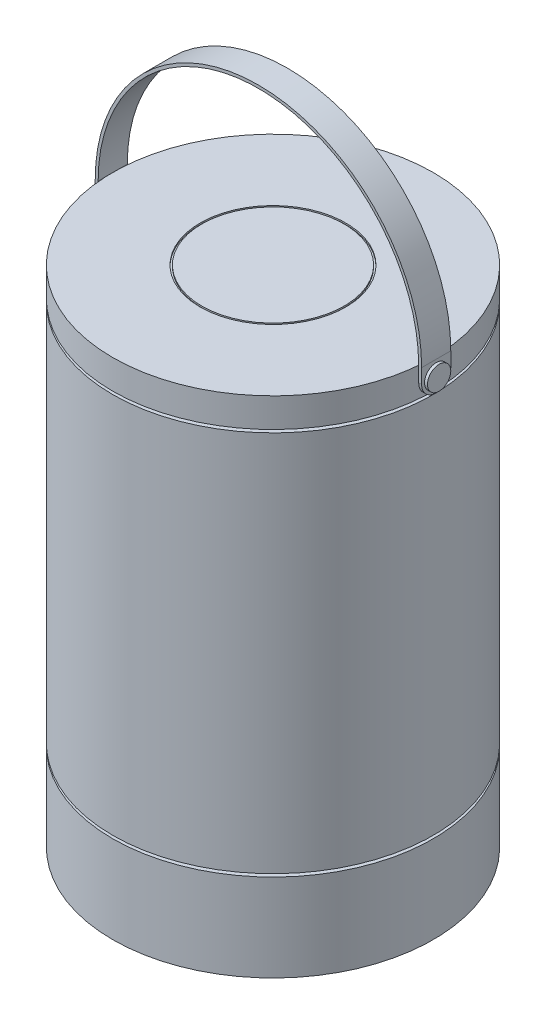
from build123d import *

# Parameters (mm, degrees)
CROQUIS1_R                   = 55
SALIENTE_EXTRUIR1_DEPTH      = 173
CROQUIS2_R                   = 55
CROQUIS2_R_2                 = 40
CORTAR_EXTRUIR1_DEPTH        = 1
CORTAR_EXTRUIR2_START        = -1
CROQUIS4_R                   = 55
CROQUIS4_R_2                 = 40
CORTAR_EXTRUIR2_DEPTH        = 1
SALIENTE_EXTRUIR2_DEPTH      = 5
SALIENTE_EXTRUIR2_DEPTH_BACK = 5
REDONDEO1_RADIUS             = 5
REDONDEO1_LENGTH             = 1
REDONDEO2_RADIUS             = 5
REDONDEO2_LENGTH             = 1
CROQUIS7_R                   = 4
SALIENTE_EXTRUIR3_DEPTH      = 1
CROQUIS8_R                   = 25
CROQUIS8_R_2                 = 24.42
CORTAR_EXTRUIR3_DEPTH        = 0.5


with BuildPart() as part:
    # Croquis1 → Saliente-Extruir1 (new body)
    with BuildSketch(Plane(origin=(0, 0, 0), x_dir=(1, 0, 0), z_dir=(0, 1, 0))):
        with Locations(Location((0, 0, 0), (0, 0, 270))):
            Circle(CROQUIS1_R)
    extrude(amount=SALIENTE_EXTRUIR1_DEPTH)

    # Croquis2 → Cortar-Extruir1 (cut)
    with BuildSketch(Plane(origin=(0, 30, 0), x_dir=(-1, 0, 0), z_dir=(0, -1, 0))):
        with Locations(Location((0, 0, 0), (0, 0, 90))):
            Circle(CROQUIS2_R)
        with Locations(Location((0, 0, 0), (0, 0, 90))):
            Circle(CROQUIS2_R_2, mode=Mode.SUBTRACT)
    extrude(amount=-CORTAR_EXTRUIR1_DEPTH, mode=Mode.SUBTRACT)

    # Croquis4 → Cortar-Extruir2 (cut)
    with BuildSketch(Plane(origin=(0, 163, 0), x_dir=(1, 0, 0), z_dir=(0, 1, 0)).offset(CORTAR_EXTRUIR2_START)):
        with Locations(Location((0, 0, 0), (0, 0, 90))):
            Circle(CROQUIS4_R)
        with Locations(Location((0, 0, 0), (0, 0, 90))):
            Circle(CROQUIS4_R_2, mode=Mode.SUBTRACT)
    extrude(amount=CORTAR_EXTRUIR2_DEPTH, mode=Mode.SUBTRACT)

    # Croquis8 → Cortar-Extruir3 (cut)
    with BuildSketch(Plane(origin=(0, 173, 0), x_dir=(1, 0, 0), z_dir=(0, 1, 0))):
        with Locations(Location((0, 0, 0), (0, 0, 270))):
            Circle(CROQUIS8_R)
        with Locations(Location((0, 0, 0), (0, 0, 270))):
            Circle(CROQUIS8_R_2, mode=Mode.SUBTRACT)
    extrude(amount=-CORTAR_EXTRUIR3_DEPTH, mode=Mode.SUBTRACT)


with BuildPart() as body_2:
    # Croquis5 → Saliente-Extruir2 (new, two sides: drawn at the far end of the back side and taken through both)
    with BuildSketch(Plane.XY.offset(-SALIENTE_EXTRUIR2_DEPTH_BACK)):
        with BuildLine():
            Line((-55, 173), (-55, 163))
            Line((-55, 163), (-56, 163))
            Line((-56, 163), (-56, 173))
            ThreePointArc((-56, 173), (0, 229), (56, 173))
            Line((56, 173), (56, 163))
            Line((56, 163), (55, 163))
            Line((55, 163), (55, 173))
            ThreePointArc((55, 173), (0, 228), (-55, 173))
        make_face()
    extrude(amount=SALIENTE_EXTRUIR2_DEPTH + SALIENTE_EXTRUIR2_DEPTH_BACK)

    # Redondeo1: full round fillet: the end face becomes a half cylinder, R = half its width
    redondeo1_face = Plane((-55.5, 163, 0), x_dir=(1, 0, 0), z_dir=(0, -1, 0))  # on the end face: x along it, z out of the body
    redondeo1_slab = redondeo1_face.offset(-REDONDEO1_RADIUS / 2) * Box(REDONDEO1_LENGTH, 2 * REDONDEO1_RADIUS, REDONDEO1_RADIUS, mode=Mode.PRIVATE)  # the body's end, R deep
    redondeo1_round = Plane((-55.5, 168, 0), x_dir=(0, -1, 0), z_dir=(1, 0, 0)) * Cylinder(REDONDEO1_RADIUS, REDONDEO1_LENGTH, mode=Mode.PRIVATE)  # its axis R under the face
    add(redondeo1_slab - redondeo1_round, mode=Mode.SUBTRACT)

    # Redondeo2: full round fillet: the end face becomes a half cylinder, R = half its width
    redondeo2_face = Plane((55.5, 163, 0), x_dir=(1, 0, 0), z_dir=(0, -1, 0))  # on the end face: x along it, z out of the body
    redondeo2_slab = redondeo2_face.offset(-REDONDEO2_RADIUS / 2) * Box(REDONDEO2_LENGTH, 2 * REDONDEO2_RADIUS, REDONDEO2_RADIUS, mode=Mode.PRIVATE)  # the body's end, R deep
    redondeo2_round = Plane((55.5, 168, 0), x_dir=(0, -1, 0), z_dir=(1, 0, 0)) * Cylinder(REDONDEO2_RADIUS, REDONDEO2_LENGTH, mode=Mode.PRIVATE)  # its axis R under the face
    add(redondeo2_slab - redondeo2_round, mode=Mode.SUBTRACT)

    # Croquis7 → Saliente-Extruir3 (add)
    with BuildSketch(Plane(origin=(56, 0, 0), x_dir=(0, 0, -1), z_dir=(1, 0, 0))):
        with Locations((0, 168)):
            Circle(CROQUIS7_R)
    saliente_extruir3 = extrude(amount=SALIENTE_EXTRUIR3_DEPTH)

    # Simetr_a1: Saliente-Extruir3 across plane
    add(saliente_extruir3.mirror(Plane(origin=(0, 0, 0), x_dir=(0, 0, 1), z_dir=(1, 0, 0))))


solid = Compound([part.part, body_2.part])
